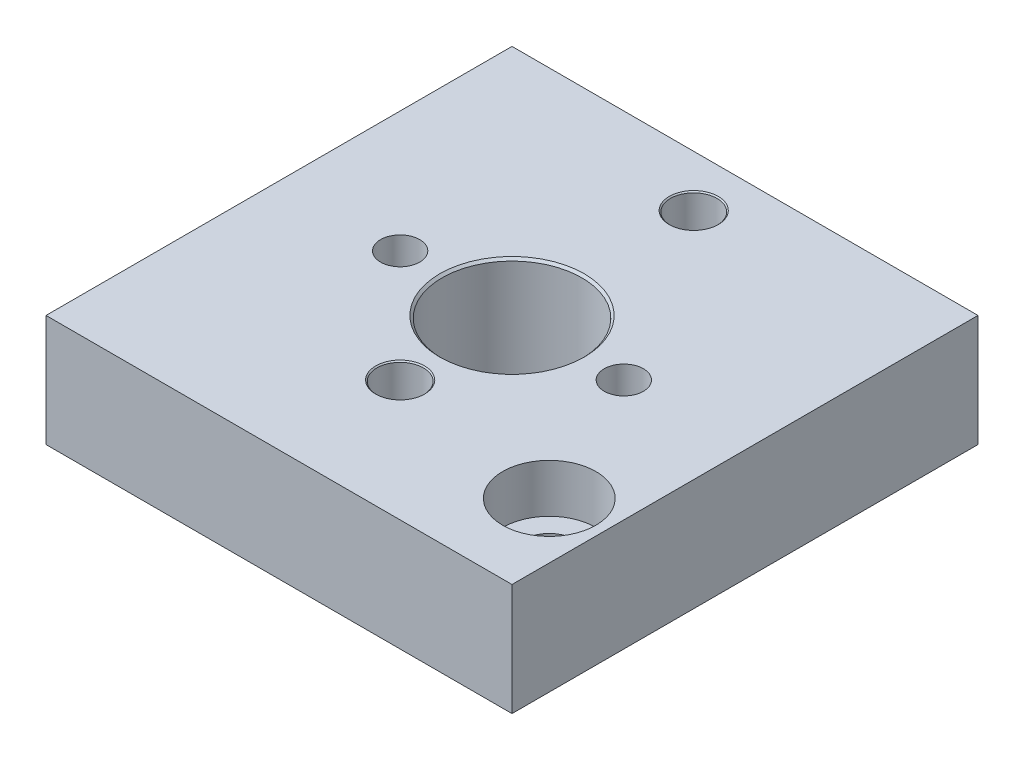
ISO-10303-21;
HEADER;
FILE_DESCRIPTION(('STEP AP214'),'2;1');
FILE_NAME('part.step','',(''),(''),'','','');
FILE_SCHEMA(('AUTOMOTIVE_DESIGN { 1 0 10303 214 1 1 1 1 }'));
ENDSEC;
DATA;
#1=APPLICATION_CONTEXT('core data for automotive mechanical design processes');
#2=APPLICATION_PROTOCOL_DEFINITION('international standard','automotive_design',2000,#1);
#3=PRODUCT_CONTEXT('',#1,'mechanical');
#4=PRODUCT('Part','Part','',(#3));
#5=PRODUCT_RELATED_PRODUCT_CATEGORY('part','',(#4));
#6=PRODUCT_DEFINITION_FORMATION('','',#4);
#7=PRODUCT_DEFINITION_CONTEXT('part definition',#1,'design');
#8=PRODUCT_DEFINITION('design','',#6,#7);
#9=PRODUCT_DEFINITION_SHAPE('','',#8);
#10=(LENGTH_UNIT() NAMED_UNIT(*) SI_UNIT(.MILLI.,.METRE.));
#11=(NAMED_UNIT(*) PLANE_ANGLE_UNIT() SI_UNIT($,.RADIAN.));
#12=(NAMED_UNIT(*) SI_UNIT($,.STERADIAN.) SOLID_ANGLE_UNIT());
#13=UNCERTAINTY_MEASURE_WITH_UNIT(LENGTH_MEASURE(1.E-05),#10,'distance_accuracy_value','');
#14=(GEOMETRIC_REPRESENTATION_CONTEXT(3) GLOBAL_UNCERTAINTY_ASSIGNED_CONTEXT((#13)) GLOBAL_UNIT_ASSIGNED_CONTEXT((#10,
#11,#12)) REPRESENTATION_CONTEXT('',''));
#15=CARTESIAN_POINT('',(0.,0.,0.));
#16=DIRECTION('',(0.,0.,1.));
#17=DIRECTION('',(1.,0.,0.));
#18=AXIS2_PLACEMENT_3D('',#15,#16,#17);
#19=CARTESIAN_POINT('',(13.,12.,-25.));
#20=DIRECTION('',(0.,1.,0.));
#21=DIRECTION('',(0.,0.,1.));
#22=AXIS2_PLACEMENT_3D('',#19,#20,#21);
#23=CYLINDRICAL_SURFACE('',#22,2.09999999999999);
#24=CARTESIAN_POINT('',(13.,12.,-25.));
#25=DIRECTION('',(0.,1.,0.));
#26=DIRECTION('',(0.,0.,1.));
#27=AXIS2_PLACEMENT_3D('',#24,#25,#26);
#28=CIRCLE('',#27,2.09999999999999);
#29=CARTESIAN_POINT('',(13.,12.,-22.9));
#30=VERTEX_POINT('',#29);
#31=EDGE_CURVE('E9284',#30,#30,#28,.T.);
#32=ORIENTED_EDGE('',*,*,#31,.T.);
#33=EDGE_LOOP('',(#32));
#34=FACE_BOUND('',#33,.T.);
#35=CARTESIAN_POINT('',(13.,4.2,-25.));
#36=DIRECTION('',(0.,-1.,0.));
#37=DIRECTION('',(0.,0.,-1.));
#38=AXIS2_PLACEMENT_3D('',#35,#36,#37);
#39=CIRCLE('',#38,2.09999999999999);
#40=CARTESIAN_POINT('',(13.,4.2,-27.1));
#41=VERTEX_POINT('',#40);
#42=EDGE_CURVE('E9179',#41,#41,#39,.F.);
#43=ORIENTED_EDGE('',*,*,#42,.F.);
#44=EDGE_LOOP('',(#43));
#45=FACE_BOUND('',#44,.T.);
#46=ADVANCED_FACE('F9175',(#34,#45),#23,.F.);
#47=CARTESIAN_POINT('',(37.,12.,-25.));
#48=DIRECTION('',(0.,1.,0.));
#49=DIRECTION('',(0.,0.,1.));
#50=AXIS2_PLACEMENT_3D('',#47,#48,#49);
#51=CYLINDRICAL_SURFACE('',#50,2.09999999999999);
#52=CARTESIAN_POINT('',(37.,12.,-25.));
#53=DIRECTION('',(0.,1.,0.));
#54=DIRECTION('',(0.,0.,1.));
#55=AXIS2_PLACEMENT_3D('',#52,#53,#54);
#56=CIRCLE('',#55,2.09999999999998);
#57=CARTESIAN_POINT('',(37.,12.,-22.9));
#58=VERTEX_POINT('',#57);
#59=EDGE_CURVE('E9281',#58,#58,#56,.T.);
#60=ORIENTED_EDGE('',*,*,#59,.T.);
#61=EDGE_LOOP('',(#60));
#62=FACE_BOUND('',#61,.T.);
#63=CARTESIAN_POINT('',(37.,4.2,-25.));
#64=DIRECTION('',(0.,-1.,0.));
#65=DIRECTION('',(0.,0.,-1.));
#66=AXIS2_PLACEMENT_3D('',#63,#64,#65);
#67=CIRCLE('',#66,2.09999999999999);
#68=CARTESIAN_POINT('',(37.,4.2,-27.1));
#69=VERTEX_POINT('',#68);
#70=EDGE_CURVE('E9255',#69,#69,#67,.F.);
#71=ORIENTED_EDGE('',*,*,#70,.F.);
#72=EDGE_LOOP('',(#71));
#73=FACE_BOUND('',#72,.T.);
#74=ADVANCED_FACE('F9342',(#62,#73),#51,.F.);
#75=CARTESIAN_POINT('',(0.,0.,-50.));
#76=DIRECTION('',(0.,-1.,0.));
#77=DIRECTION('',(0.,0.,-1.));
#78=AXIS2_PLACEMENT_3D('',#75,#76,#77);
#79=PLANE('',#78);
#80=CARTESIAN_POINT('',(13.,0.,-25.));
#81=DIRECTION('',(0.,-1.,0.));
#82=DIRECTION('',(0.,0.,-1.));
#83=AXIS2_PLACEMENT_3D('',#80,#81,#82);
#84=CIRCLE('',#83,4.);
#85=CARTESIAN_POINT('',(13.,0.,-29.));
#86=VERTEX_POINT('',#85);
#87=EDGE_CURVE('E9395',#86,#86,#84,.T.);
#88=ORIENTED_EDGE('',*,*,#87,.F.);
#89=EDGE_LOOP('',(#88));
#90=FACE_BOUND('',#89,.T.);
#91=CARTESIAN_POINT('',(37.,0.,-25.));
#92=DIRECTION('',(0.,-1.,0.));
#93=DIRECTION('',(0.,0.,-1.));
#94=AXIS2_PLACEMENT_3D('',#91,#92,#93);
#95=CIRCLE('',#94,4.);
#96=CARTESIAN_POINT('',(37.,0.,-29.));
#97=VERTEX_POINT('',#96);
#98=EDGE_CURVE('E9265',#97,#97,#95,.T.);
#99=ORIENTED_EDGE('',*,*,#98,.F.);
#100=EDGE_LOOP('',(#99));
#101=FACE_BOUND('',#100,.T.);
#102=CARTESIAN_POINT('',(25.,-4.5102810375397E-13,-44.5));
#103=DIRECTION('',(0.,1.,0.));
#104=DIRECTION('',(0.,0.,1.));
#105=AXIS2_PLACEMENT_3D('',#102,#103,#104);
#106=CIRCLE('',#105,2.625);
#107=CARTESIAN_POINT('',(25.,-4.5102810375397E-13,-41.875));
#108=VERTEX_POINT('',#107);
#109=EDGE_CURVE('E9287',#108,#108,#106,.T.);
#110=ORIENTED_EDGE('',*,*,#109,.T.);
#111=EDGE_LOOP('',(#110));
#112=FACE_BOUND('',#111,.T.);
#113=CARTESIAN_POINT('',(25.,0.,-25.));
#114=DIRECTION('',(0.,1.,0.));
#115=DIRECTION('',(0.,0.,1.));
#116=AXIS2_PLACEMENT_3D('',#113,#114,#115);
#117=CIRCLE('',#116,7.75);
#118=CARTESIAN_POINT('',(25.,0.,-17.25));
#119=VERTEX_POINT('',#118);
#120=EDGE_CURVE('E9311',#119,#119,#117,.T.);
#121=ORIENTED_EDGE('',*,*,#120,.T.);
#122=EDGE_LOOP('',(#121));
#123=FACE_BOUND('',#122,.T.);
#124=DIRECTION('',(0.,0.,1.));
#125=VECTOR('',#124,1.);
#126=CARTESIAN_POINT('',(0.,0.,0.));
#127=LINE('',#126,#125);
#128=CARTESIAN_POINT('',(0.,0.,-50.));
#129=VERTEX_POINT('',#128);
#130=CARTESIAN_POINT('',(0.,0.,0.));
#131=VERTEX_POINT('',#130);
#132=EDGE_CURVE('E9223',#129,#131,#127,.T.);
#133=ORIENTED_EDGE('',*,*,#132,.F.);
#134=DIRECTION('',(-1.,0.,0.));
#135=VECTOR('',#134,1.);
#136=CARTESIAN_POINT('',(0.,0.,-50.));
#137=LINE('',#136,#135);
#138=CARTESIAN_POINT('',(50.,0.,-50.));
#139=VERTEX_POINT('',#138);
#140=EDGE_CURVE('E9244',#139,#129,#137,.T.);
#141=ORIENTED_EDGE('',*,*,#140,.F.);
#142=DIRECTION('',(0.,0.,-1.));
#143=VECTOR('',#142,1.);
#144=CARTESIAN_POINT('',(50.,0.,0.));
#145=LINE('',#144,#143);
#146=CARTESIAN_POINT('',(50.,0.,0.));
#147=VERTEX_POINT('',#146);
#148=EDGE_CURVE('E9224',#147,#139,#145,.T.);
#149=ORIENTED_EDGE('',*,*,#148,.F.);
#150=DIRECTION('',(1.,0.,0.));
#151=VECTOR('',#150,1.);
#152=CARTESIAN_POINT('',(0.,0.,0.));
#153=LINE('',#152,#151);
#154=EDGE_CURVE('E9218',#131,#147,#153,.T.);
#155=ORIENTED_EDGE('',*,*,#154,.F.);
#156=EDGE_LOOP('',(#133,#141,#149,#155));
#157=FACE_BOUND('',#156,.T.);
#158=CARTESIAN_POINT('',(25.,-4.5102810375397E-13,-13.));
#159=DIRECTION('',(0.,1.,0.));
#160=DIRECTION('',(0.,0.,1.));
#161=AXIS2_PLACEMENT_3D('',#158,#159,#160);
#162=CIRCLE('',#161,2.625);
#163=CARTESIAN_POINT('',(25.,-4.5102810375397E-13,-10.375));
#164=VERTEX_POINT('',#163);
#165=EDGE_CURVE('E9299',#164,#164,#162,.T.);
#166=ORIENTED_EDGE('',*,*,#165,.T.);
#167=EDGE_LOOP('',(#166));
#168=FACE_BOUND('',#167,.T.);
#169=CARTESIAN_POINT('',(44.,-4.5102810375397E-13,-10.));
#170=DIRECTION('',(0.,1.,0.));
#171=DIRECTION('',(0.,0.,1.));
#172=AXIS2_PLACEMENT_3D('',#169,#170,#171);
#173=CIRCLE('',#172,2.75);
#174=CARTESIAN_POINT('',(44.,-4.5102810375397E-13,-7.25));
#175=VERTEX_POINT('',#174);
#176=EDGE_CURVE('E9257',#175,#175,#173,.T.);
#177=ORIENTED_EDGE('',*,*,#176,.T.);
#178=EDGE_LOOP('',(#177));
#179=FACE_BOUND('',#178,.T.);
#180=ADVANCED_FACE('F9219',(#90,#101,#112,#123,#157,#168,#179),#79,.T.);
#181=CARTESIAN_POINT('',(0.,12.,0.));
#182=DIRECTION('',(1.,0.,0.));
#183=DIRECTION('',(0.,0.,-1.));
#184=AXIS2_PLACEMENT_3D('',#181,#182,#183);
#185=PLANE('',#184);
#186=ORIENTED_EDGE('',*,*,#132,.T.);
#187=DIRECTION('',(0.,-1.,0.));
#188=VECTOR('',#187,1.);
#189=CARTESIAN_POINT('',(0.,12.,0.));
#190=LINE('',#189,#188);
#191=CARTESIAN_POINT('',(0.,12.,0.));
#192=VERTEX_POINT('',#191);
#193=EDGE_CURVE('E11',#192,#131,#190,.T.);
#194=ORIENTED_EDGE('',*,*,#193,.F.);
#195=DIRECTION('',(0.,0.,1.));
#196=VECTOR('',#195,1.);
#197=CARTESIAN_POINT('',(0.,12.,0.));
#198=LINE('',#197,#196);
#199=CARTESIAN_POINT('',(0.,12.,-50.));
#200=VERTEX_POINT('',#199);
#201=EDGE_CURVE('E9246',#200,#192,#198,.T.);
#202=ORIENTED_EDGE('',*,*,#201,.F.);
#203=DIRECTION('',(0.,-1.,0.));
#204=VECTOR('',#203,1.);
#205=CARTESIAN_POINT('',(0.,12.,-50.));
#206=LINE('',#205,#204);
#207=EDGE_CURVE('E9235',#200,#129,#206,.T.);
#208=ORIENTED_EDGE('',*,*,#207,.T.);
#209=EDGE_LOOP('',(#186,#194,#202,#208));
#210=FACE_BOUND('',#209,.T.);
#211=ADVANCED_FACE('F9177',(#210),#185,.F.);
#212=CARTESIAN_POINT('',(0.,12.,0.));
#213=DIRECTION('',(0.,0.,-1.));
#214=DIRECTION('',(-1.,0.,0.));
#215=AXIS2_PLACEMENT_3D('',#212,#213,#214);
#216=PLANE('',#215);
#217=ORIENTED_EDGE('',*,*,#154,.T.);
#218=DIRECTION('',(0.,-1.,0.));
#219=VECTOR('',#218,1.);
#220=CARTESIAN_POINT('',(50.,12.,0.));
#221=LINE('',#220,#219);
#222=CARTESIAN_POINT('',(50.,12.,0.));
#223=VERTEX_POINT('',#222);
#224=EDGE_CURVE('E9184',#223,#147,#221,.T.);
#225=ORIENTED_EDGE('',*,*,#224,.F.);
#226=DIRECTION('',(1.,0.,0.));
#227=VECTOR('',#226,1.);
#228=CARTESIAN_POINT('',(0.,12.,0.));
#229=LINE('',#228,#227);
#230=EDGE_CURVE('E9231',#192,#223,#229,.T.);
#231=ORIENTED_EDGE('',*,*,#230,.F.);
#232=ORIENTED_EDGE('',*,*,#193,.T.);
#233=EDGE_LOOP('',(#217,#225,#231,#232));
#234=FACE_BOUND('',#233,.T.);
#235=ADVANCED_FACE('F9230',(#234),#216,.F.);
#236=CARTESIAN_POINT('',(50.,12.,0.));
#237=DIRECTION('',(-1.,0.,0.));
#238=DIRECTION('',(0.,0.,1.));
#239=AXIS2_PLACEMENT_3D('',#236,#237,#238);
#240=PLANE('',#239);
#241=ORIENTED_EDGE('',*,*,#148,.T.);
#242=DIRECTION('',(0.,-1.,0.));
#243=VECTOR('',#242,1.);
#244=CARTESIAN_POINT('',(50.,12.,-50.));
#245=LINE('',#244,#243);
#246=CARTESIAN_POINT('',(50.,12.,-50.));
#247=VERTEX_POINT('',#246);
#248=EDGE_CURVE('E9252',#247,#139,#245,.T.);
#249=ORIENTED_EDGE('',*,*,#248,.F.);
#250=DIRECTION('',(0.,0.,-1.));
#251=VECTOR('',#250,1.);
#252=CARTESIAN_POINT('',(50.,12.,0.));
#253=LINE('',#252,#251);
#254=EDGE_CURVE('E9197',#223,#247,#253,.T.);
#255=ORIENTED_EDGE('',*,*,#254,.F.);
#256=ORIENTED_EDGE('',*,*,#224,.T.);
#257=EDGE_LOOP('',(#241,#249,#255,#256));
#258=FACE_BOUND('',#257,.T.);
#259=ADVANCED_FACE('F9333',(#258),#240,.F.);
#260=CARTESIAN_POINT('',(0.,12.,-50.));
#261=DIRECTION('',(0.,0.,1.));
#262=DIRECTION('',(1.,0.,0.));
#263=AXIS2_PLACEMENT_3D('',#260,#261,#262);
#264=PLANE('',#263);
#265=ORIENTED_EDGE('',*,*,#140,.T.);
#266=ORIENTED_EDGE('',*,*,#207,.F.);
#267=DIRECTION('',(-1.,0.,0.));
#268=VECTOR('',#267,1.);
#269=CARTESIAN_POINT('',(0.,12.,-50.));
#270=LINE('',#269,#268);
#271=EDGE_CURVE('E9192',#247,#200,#270,.T.);
#272=ORIENTED_EDGE('',*,*,#271,.F.);
#273=ORIENTED_EDGE('',*,*,#248,.T.);
#274=EDGE_LOOP('',(#265,#266,#272,#273));
#275=FACE_BOUND('',#274,.T.);
#276=ADVANCED_FACE('F9329',(#275),#264,.F.);
#277=CARTESIAN_POINT('',(0.,12.,-50.));
#278=DIRECTION('',(0.,-1.,0.));
#279=DIRECTION('',(0.,0.,-1.));
#280=AXIS2_PLACEMENT_3D('',#277,#278,#279);
#281=PLANE('',#280);
#282=CARTESIAN_POINT('',(44.,12.,-10.));
#283=DIRECTION('',(0.,1.,0.));
#284=DIRECTION('',(0.,0.,1.));
#285=AXIS2_PLACEMENT_3D('',#282,#283,#284);
#286=CIRCLE('',#285,4.99999999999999);
#287=CARTESIAN_POINT('',(44.,12.,-5.00000000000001));
#288=VERTEX_POINT('',#287);
#289=EDGE_CURVE('E9278',#288,#288,#286,.T.);
#290=ORIENTED_EDGE('',*,*,#289,.F.);
#291=EDGE_LOOP('',(#290));
#292=FACE_BOUND('',#291,.T.);
#293=ORIENTED_EDGE('',*,*,#59,.F.);
#294=EDGE_LOOP('',(#293));
#295=FACE_BOUND('',#294,.T.);
#296=ORIENTED_EDGE('',*,*,#31,.F.);
#297=EDGE_LOOP('',(#296));
#298=FACE_BOUND('',#297,.T.);
#299=CARTESIAN_POINT('',(25.,12.,-44.5));
#300=DIRECTION('',(0.,1.,0.));
#301=DIRECTION('',(0.,0.,1.));
#302=AXIS2_PLACEMENT_3D('',#299,#300,#301);
#303=CIRCLE('',#302,2.625);
#304=CARTESIAN_POINT('',(25.,12.,-41.875));
#305=VERTEX_POINT('',#304);
#306=EDGE_CURVE('E9296',#305,#305,#303,.T.);
#307=ORIENTED_EDGE('',*,*,#306,.F.);
#308=EDGE_LOOP('',(#307));
#309=FACE_BOUND('',#308,.T.);
#310=CARTESIAN_POINT('',(25.,12.,-13.));
#311=DIRECTION('',(0.,1.,0.));
#312=DIRECTION('',(0.,0.,1.));
#313=AXIS2_PLACEMENT_3D('',#310,#311,#312);
#314=CIRCLE('',#313,2.625);
#315=CARTESIAN_POINT('',(25.,12.,-10.375));
#316=VERTEX_POINT('',#315);
#317=EDGE_CURVE('E9308',#316,#316,#314,.T.);
#318=ORIENTED_EDGE('',*,*,#317,.F.);
#319=EDGE_LOOP('',(#318));
#320=FACE_BOUND('',#319,.T.);
#321=CARTESIAN_POINT('',(25.,12.,-25.));
#322=DIRECTION('',(0.,1.,0.));
#323=DIRECTION('',(0.,0.,1.));
#324=AXIS2_PLACEMENT_3D('',#321,#322,#323);
#325=CIRCLE('',#324,7.75);
#326=CARTESIAN_POINT('',(25.,12.,-17.25));
#327=VERTEX_POINT('',#326);
#328=EDGE_CURVE('E9236',#327,#327,#325,.T.);
#329=ORIENTED_EDGE('',*,*,#328,.F.);
#330=EDGE_LOOP('',(#329));
#331=FACE_BOUND('',#330,.T.);
#332=ORIENTED_EDGE('',*,*,#201,.T.);
#333=ORIENTED_EDGE('',*,*,#230,.T.);
#334=ORIENTED_EDGE('',*,*,#254,.T.);
#335=ORIENTED_EDGE('',*,*,#271,.T.);
#336=EDGE_LOOP('',(#332,#333,#334,#335));
#337=FACE_BOUND('',#336,.T.);
#338=ADVANCED_FACE('F9324',(#292,#295,#298,#309,#320,#331,#337),#281,.F.);
#339=CARTESIAN_POINT('',(25.,12.,-25.));
#340=DIRECTION('',(0.,1.,0.));
#341=DIRECTION('',(0.,0.,1.));
#342=AXIS2_PLACEMENT_3D('',#339,#340,#341);
#343=CONICAL_SURFACE('',#342,7.75,0.785398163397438);
#344=CARTESIAN_POINT('',(25.,11.75,-25.));
#345=DIRECTION('',(0.,1.,0.));
#346=DIRECTION('',(0.,0.,1.));
#347=AXIS2_PLACEMENT_3D('',#344,#345,#346);
#348=CIRCLE('',#347,7.5);
#349=CARTESIAN_POINT('',(25.,11.75,-17.5));
#350=VERTEX_POINT('',#349);
#351=EDGE_CURVE('E9239',#350,#350,#348,.T.);
#352=ORIENTED_EDGE('',*,*,#351,.F.);
#353=EDGE_LOOP('',(#352));
#354=FACE_BOUND('',#353,.T.);
#355=ORIENTED_EDGE('',*,*,#328,.T.);
#356=EDGE_LOOP('',(#355));
#357=FACE_BOUND('',#356,.T.);
#358=ADVANCED_FACE('F9321',(#354,#357),#343,.F.);
#359=CARTESIAN_POINT('',(25.,12.,-25.));
#360=DIRECTION('',(0.,1.,0.));
#361=DIRECTION('',(0.,0.,1.));
#362=AXIS2_PLACEMENT_3D('',#359,#360,#361);
#363=CYLINDRICAL_SURFACE('',#362,7.5);
#364=CARTESIAN_POINT('',(25.,0.250000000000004,-25.));
#365=DIRECTION('',(0.,1.,0.));
#366=DIRECTION('',(0.,0.,1.));
#367=AXIS2_PLACEMENT_3D('',#364,#365,#366);
#368=CIRCLE('',#367,7.5);
#369=CARTESIAN_POINT('',(25.,0.250000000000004,-17.5));
#370=VERTEX_POINT('',#369);
#371=EDGE_CURVE('E9314',#370,#370,#368,.T.);
#372=ORIENTED_EDGE('',*,*,#371,.F.);
#373=EDGE_LOOP('',(#372));
#374=FACE_BOUND('',#373,.T.);
#375=ORIENTED_EDGE('',*,*,#351,.T.);
#376=EDGE_LOOP('',(#375));
#377=FACE_BOUND('',#376,.T.);
#378=ADVANCED_FACE('F9319',(#374,#377),#363,.F.);
#379=CARTESIAN_POINT('',(25.,0.250000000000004,-25.));
#380=DIRECTION('',(0.,-1.,0.));
#381=DIRECTION('',(0.,0.,-1.));
#382=AXIS2_PLACEMENT_3D('',#379,#380,#381);
#383=CONICAL_SURFACE('',#382,7.5,0.785398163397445);
#384=ORIENTED_EDGE('',*,*,#120,.F.);
#385=EDGE_LOOP('',(#384));
#386=FACE_BOUND('',#385,.T.);
#387=ORIENTED_EDGE('',*,*,#371,.T.);
#388=EDGE_LOOP('',(#387));
#389=FACE_BOUND('',#388,.T.);
#390=ADVANCED_FACE('F9379',(#386,#389),#383,.F.);
#391=CARTESIAN_POINT('',(25.,12.,-13.));
#392=DIRECTION('',(0.,1.,0.));
#393=DIRECTION('',(0.,0.,1.));
#394=AXIS2_PLACEMENT_3D('',#391,#392,#393);
#395=CONICAL_SURFACE('',#394,2.625,0.785398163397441);
#396=CARTESIAN_POINT('',(25.,11.875,-13.));
#397=DIRECTION('',(0.,1.,0.));
#398=DIRECTION('',(0.,0.,1.));
#399=AXIS2_PLACEMENT_3D('',#396,#397,#398);
#400=CIRCLE('',#399,2.49999999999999);
#401=CARTESIAN_POINT('',(25.,11.875,-10.5));
#402=VERTEX_POINT('',#401);
#403=EDGE_CURVE('E9305',#402,#402,#400,.T.);
#404=ORIENTED_EDGE('',*,*,#403,.F.);
#405=EDGE_LOOP('',(#404));
#406=FACE_BOUND('',#405,.T.);
#407=ORIENTED_EDGE('',*,*,#317,.T.);
#408=EDGE_LOOP('',(#407));
#409=FACE_BOUND('',#408,.T.);
#410=ADVANCED_FACE('F9375',(#406,#409),#395,.F.);
#411=CARTESIAN_POINT('',(25.,12.,-13.));
#412=DIRECTION('',(0.,1.,0.));
#413=DIRECTION('',(0.,0.,1.));
#414=AXIS2_PLACEMENT_3D('',#411,#412,#413);
#415=CYLINDRICAL_SURFACE('',#414,2.49999999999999);
#416=CARTESIAN_POINT('',(25.,0.124999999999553,-13.));
#417=DIRECTION('',(0.,1.,0.));
#418=DIRECTION('',(0.,0.,1.));
#419=AXIS2_PLACEMENT_3D('',#416,#417,#418);
#420=CIRCLE('',#419,2.5);
#421=CARTESIAN_POINT('',(25.,0.124999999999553,-10.5));
#422=VERTEX_POINT('',#421);
#423=EDGE_CURVE('E9302',#422,#422,#420,.T.);
#424=ORIENTED_EDGE('',*,*,#423,.F.);
#425=EDGE_LOOP('',(#424));
#426=FACE_BOUND('',#425,.T.);
#427=ORIENTED_EDGE('',*,*,#403,.T.);
#428=EDGE_LOOP('',(#427));
#429=FACE_BOUND('',#428,.T.);
#430=ADVANCED_FACE('F9371',(#426,#429),#415,.F.);
#431=CARTESIAN_POINT('',(25.,0.124999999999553,-13.));
#432=DIRECTION('',(0.,-1.,0.));
#433=DIRECTION('',(0.,0.,-1.));
#434=AXIS2_PLACEMENT_3D('',#431,#432,#433);
#435=CONICAL_SURFACE('',#434,2.5,0.785398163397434);
#436=ORIENTED_EDGE('',*,*,#165,.F.);
#437=EDGE_LOOP('',(#436));
#438=FACE_BOUND('',#437,.T.);
#439=ORIENTED_EDGE('',*,*,#423,.T.);
#440=EDGE_LOOP('',(#439));
#441=FACE_BOUND('',#440,.T.);
#442=ADVANCED_FACE('F9367',(#438,#441),#435,.F.);
#443=CARTESIAN_POINT('',(25.,12.,-44.5));
#444=DIRECTION('',(0.,1.,0.));
#445=DIRECTION('',(0.,0.,1.));
#446=AXIS2_PLACEMENT_3D('',#443,#444,#445);
#447=CONICAL_SURFACE('',#446,2.625,0.785398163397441);
#448=CARTESIAN_POINT('',(25.,11.875,-44.5));
#449=DIRECTION('',(0.,1.,0.));
#450=DIRECTION('',(0.,0.,1.));
#451=AXIS2_PLACEMENT_3D('',#448,#449,#450);
#452=CIRCLE('',#451,2.49999999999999);
#453=CARTESIAN_POINT('',(25.,11.875,-42.));
#454=VERTEX_POINT('',#453);
#455=EDGE_CURVE('E9293',#454,#454,#452,.T.);
#456=ORIENTED_EDGE('',*,*,#455,.F.);
#457=EDGE_LOOP('',(#456));
#458=FACE_BOUND('',#457,.T.);
#459=ORIENTED_EDGE('',*,*,#306,.T.);
#460=EDGE_LOOP('',(#459));
#461=FACE_BOUND('',#460,.T.);
#462=ADVANCED_FACE('F9363',(#458,#461),#447,.F.);
#463=CARTESIAN_POINT('',(25.,12.,-44.5));
#464=DIRECTION('',(0.,1.,0.));
#465=DIRECTION('',(0.,0.,1.));
#466=AXIS2_PLACEMENT_3D('',#463,#464,#465);
#467=CYLINDRICAL_SURFACE('',#466,2.49999999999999);
#468=CARTESIAN_POINT('',(25.,0.124999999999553,-44.5));
#469=DIRECTION('',(0.,1.,0.));
#470=DIRECTION('',(0.,0.,1.));
#471=AXIS2_PLACEMENT_3D('',#468,#469,#470);
#472=CIRCLE('',#471,2.5);
#473=CARTESIAN_POINT('',(25.,0.124999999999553,-42.));
#474=VERTEX_POINT('',#473);
#475=EDGE_CURVE('E9290',#474,#474,#472,.T.);
#476=ORIENTED_EDGE('',*,*,#475,.F.);
#477=EDGE_LOOP('',(#476));
#478=FACE_BOUND('',#477,.T.);
#479=ORIENTED_EDGE('',*,*,#455,.T.);
#480=EDGE_LOOP('',(#479));
#481=FACE_BOUND('',#480,.T.);
#482=ADVANCED_FACE('F9359',(#478,#481),#467,.F.);
#483=CARTESIAN_POINT('',(25.,0.124999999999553,-44.5));
#484=DIRECTION('',(0.,-1.,0.));
#485=DIRECTION('',(0.,0.,-1.));
#486=AXIS2_PLACEMENT_3D('',#483,#484,#485);
#487=CONICAL_SURFACE('',#486,2.5,0.785398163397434);
#488=ORIENTED_EDGE('',*,*,#109,.F.);
#489=EDGE_LOOP('',(#488));
#490=FACE_BOUND('',#489,.T.);
#491=ORIENTED_EDGE('',*,*,#475,.T.);
#492=EDGE_LOOP('',(#491));
#493=FACE_BOUND('',#492,.T.);
#494=ADVANCED_FACE('F9355',(#490,#493),#487,.F.);
#495=CARTESIAN_POINT('',(44.,12.,-10.));
#496=DIRECTION('',(0.,1.,0.));
#497=DIRECTION('',(0.,0.,1.));
#498=AXIS2_PLACEMENT_3D('',#495,#496,#497);
#499=CYLINDRICAL_SURFACE('',#498,4.99999999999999);
#500=CARTESIAN_POINT('',(44.,6.8,-10.));
#501=DIRECTION('',(0.,1.,0.));
#502=DIRECTION('',(0.,0.,1.));
#503=AXIS2_PLACEMENT_3D('',#500,#501,#502);
#504=CIRCLE('',#503,5.);
#505=CARTESIAN_POINT('',(44.,6.8,-5.));
#506=VERTEX_POINT('',#505);
#507=EDGE_CURVE('E9275',#506,#506,#504,.T.);
#508=ORIENTED_EDGE('',*,*,#507,.F.);
#509=EDGE_LOOP('',(#508));
#510=FACE_BOUND('',#509,.T.);
#511=ORIENTED_EDGE('',*,*,#289,.T.);
#512=EDGE_LOOP('',(#511));
#513=FACE_BOUND('',#512,.T.);
#514=ADVANCED_FACE('F9358',(#510,#513),#499,.F.);
#515=CARTESIAN_POINT('',(46.75,6.8,-10.));
#516=DIRECTION('',(0.,-1.,0.));
#517=DIRECTION('',(0.,0.,-1.));
#518=AXIS2_PLACEMENT_3D('',#515,#516,#517);
#519=PLANE('',#518);
#520=CARTESIAN_POINT('',(44.,6.8,-10.));
#521=DIRECTION('',(0.,1.,0.));
#522=DIRECTION('',(0.,0.,1.));
#523=AXIS2_PLACEMENT_3D('',#520,#521,#522);
#524=CIRCLE('',#523,2.75);
#525=CARTESIAN_POINT('',(44.,6.8,-7.25));
#526=VERTEX_POINT('',#525);
#527=EDGE_CURVE('E9262',#526,#526,#524,.T.);
#528=ORIENTED_EDGE('',*,*,#527,.F.);
#529=EDGE_LOOP('',(#528));
#530=FACE_BOUND('',#529,.T.);
#531=ORIENTED_EDGE('',*,*,#507,.T.);
#532=EDGE_LOOP('',(#531));
#533=FACE_BOUND('',#532,.T.);
#534=ADVANCED_FACE('F9431',(#530,#533),#519,.F.);
#535=CARTESIAN_POINT('',(44.,12.,-10.));
#536=DIRECTION('',(0.,1.,0.));
#537=DIRECTION('',(0.,0.,1.));
#538=AXIS2_PLACEMENT_3D('',#535,#536,#537);
#539=CYLINDRICAL_SURFACE('',#538,2.75);
#540=ORIENTED_EDGE('',*,*,#176,.F.);
#541=EDGE_LOOP('',(#540));
#542=FACE_BOUND('',#541,.T.);
#543=ORIENTED_EDGE('',*,*,#527,.T.);
#544=EDGE_LOOP('',(#543));
#545=FACE_BOUND('',#544,.T.);
#546=ADVANCED_FACE('F9425',(#542,#545),#539,.F.);
#547=CARTESIAN_POINT('',(37.,4.2,-25.));
#548=DIRECTION('',(0.,-1.,0.));
#549=DIRECTION('',(0.,0.,-1.));
#550=AXIS2_PLACEMENT_3D('',#547,#548,#549);
#551=PLANE('',#550);
#552=CARTESIAN_POINT('',(37.,4.2,-25.));
#553=DIRECTION('',(0.,-1.,0.));
#554=DIRECTION('',(0.,0.,-1.));
#555=AXIS2_PLACEMENT_3D('',#552,#553,#554);
#556=CIRCLE('',#555,4.);
#557=CARTESIAN_POINT('',(37.,4.2,-29.));
#558=VERTEX_POINT('',#557);
#559=EDGE_CURVE('E9258',#558,#558,#556,.T.);
#560=ORIENTED_EDGE('',*,*,#559,.T.);
#561=EDGE_LOOP('',(#560));
#562=FACE_BOUND('',#561,.T.);
#563=ORIENTED_EDGE('',*,*,#70,.T.);
#564=EDGE_LOOP('',(#563));
#565=FACE_BOUND('',#564,.T.);
#566=ADVANCED_FACE('F9416',(#562,#565),#551,.T.);
#567=CARTESIAN_POINT('',(37.,4.2,-25.));
#568=DIRECTION('',(0.,-1.,0.));
#569=DIRECTION('',(0.,0.,-1.));
#570=AXIS2_PLACEMENT_3D('',#567,#568,#569);
#571=CYLINDRICAL_SURFACE('',#570,4.);
#572=ORIENTED_EDGE('',*,*,#559,.F.);
#573=EDGE_LOOP('',(#572));
#574=FACE_BOUND('',#573,.T.);
#575=ORIENTED_EDGE('',*,*,#98,.T.);
#576=EDGE_LOOP('',(#575));
#577=FACE_BOUND('',#576,.T.);
#578=ADVANCED_FACE('F9414',(#574,#577),#571,.F.);
#579=CARTESIAN_POINT('',(13.,4.2,-25.));
#580=DIRECTION('',(0.,-1.,0.));
#581=DIRECTION('',(0.,0.,-1.));
#582=AXIS2_PLACEMENT_3D('',#579,#580,#581);
#583=PLANE('',#582);
#584=CARTESIAN_POINT('',(13.,4.2,-25.));
#585=DIRECTION('',(0.,-1.,0.));
#586=DIRECTION('',(0.,0.,-1.));
#587=AXIS2_PLACEMENT_3D('',#584,#585,#586);
#588=CIRCLE('',#587,4.);
#589=CARTESIAN_POINT('',(13.,4.2,-29.));
#590=VERTEX_POINT('',#589);
#591=EDGE_CURVE('E9485',#590,#590,#588,.T.);
#592=ORIENTED_EDGE('',*,*,#591,.T.);
#593=EDGE_LOOP('',(#592));
#594=FACE_BOUND('',#593,.T.);
#595=ORIENTED_EDGE('',*,*,#42,.T.);
#596=EDGE_LOOP('',(#595));
#597=FACE_BOUND('',#596,.T.);
#598=ADVANCED_FACE('F9415',(#594,#597),#583,.T.);
#599=CARTESIAN_POINT('',(13.,4.2,-25.));
#600=DIRECTION('',(0.,-1.,0.));
#601=DIRECTION('',(0.,0.,-1.));
#602=AXIS2_PLACEMENT_3D('',#599,#600,#601);
#603=CYLINDRICAL_SURFACE('',#602,4.);
#604=ORIENTED_EDGE('',*,*,#591,.F.);
#605=EDGE_LOOP('',(#604));
#606=FACE_BOUND('',#605,.T.);
#607=ORIENTED_EDGE('',*,*,#87,.T.);
#608=EDGE_LOOP('',(#607));
#609=FACE_BOUND('',#608,.T.);
#610=ADVANCED_FACE('F9422',(#606,#609),#603,.F.);
#611=CLOSED_SHELL('',(#46,#74,#180,#211,#235,#259,#276,#338,#358,#378,#390,#410,#430,#442,#462,
#482,#494,#514,#534,#546,#566,#578,#598,#610));
#612=MANIFOLD_SOLID_BREP('B2',#611);
#613=ADVANCED_BREP_SHAPE_REPRESENTATION('',(#18,#612),#14);
#614=SHAPE_DEFINITION_REPRESENTATION(#9,#613);
ENDSEC;
END-ISO-10303-21;
